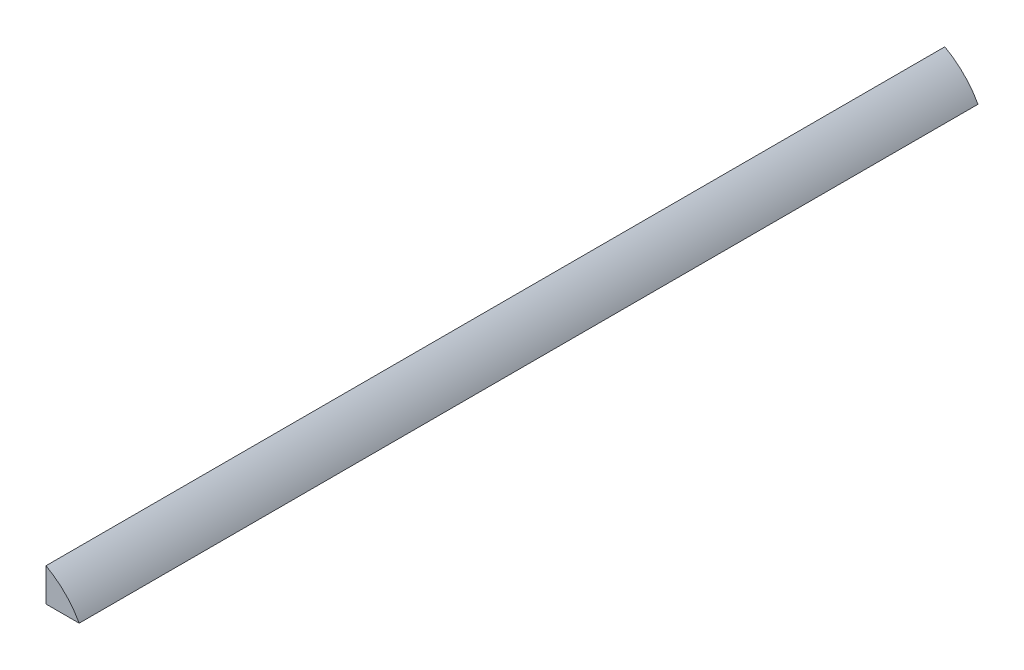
ISO-10303-21;
HEADER;
FILE_DESCRIPTION(('STEP AP214'),'2;1');
FILE_NAME('part.step','',(''),(''),'','','');
FILE_SCHEMA(('AUTOMOTIVE_DESIGN { 1 0 10303 214 1 1 1 1 }'));
ENDSEC;
DATA;
#1=APPLICATION_CONTEXT('core data for automotive mechanical design processes');
#2=APPLICATION_PROTOCOL_DEFINITION('international standard','automotive_design',2000,#1);
#3=PRODUCT_CONTEXT('',#1,'mechanical');
#4=PRODUCT('Part','Part','',(#3));
#5=PRODUCT_RELATED_PRODUCT_CATEGORY('part','',(#4));
#6=PRODUCT_DEFINITION_FORMATION('','',#4);
#7=PRODUCT_DEFINITION_CONTEXT('part definition',#1,'design');
#8=PRODUCT_DEFINITION('design','',#6,#7);
#9=PRODUCT_DEFINITION_SHAPE('','',#8);
#10=(LENGTH_UNIT() NAMED_UNIT(*) SI_UNIT(.MILLI.,.METRE.));
#11=(NAMED_UNIT(*) PLANE_ANGLE_UNIT() SI_UNIT($,.RADIAN.));
#12=(NAMED_UNIT(*) SI_UNIT($,.STERADIAN.) SOLID_ANGLE_UNIT());
#13=UNCERTAINTY_MEASURE_WITH_UNIT(LENGTH_MEASURE(1.E-05),#10,'distance_accuracy_value','');
#14=(GEOMETRIC_REPRESENTATION_CONTEXT(3) GLOBAL_UNCERTAINTY_ASSIGNED_CONTEXT((#13)) GLOBAL_UNIT_ASSIGNED_CONTEXT((#10,
#11,#12)) REPRESENTATION_CONTEXT('',''));
#15=CARTESIAN_POINT('',(0.,0.,0.));
#16=DIRECTION('',(0.,0.,1.));
#17=DIRECTION('',(1.,0.,0.));
#18=AXIS2_PLACEMENT_3D('',#15,#16,#17);
#19=CARTESIAN_POINT('',(-88.9,9.525,50.8));
#20=DIRECTION('',(0.,-1.,0.));
#21=DIRECTION('',(0.,0.,-1.));
#22=AXIS2_PLACEMENT_3D('',#19,#20,#21);
#23=PLANE('',#22);
#24=DIRECTION('',(1.,0.,0.));
#25=VECTOR('',#24,1.);
#26=CARTESIAN_POINT('',(69.85,9.525,-31.75));
#27=LINE('',#26,#25);
#28=CARTESIAN_POINT('',(79.375,9.52499999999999,-31.75));
#29=VERTEX_POINT('',#28);
#30=CARTESIAN_POINT('',(82.423,9.525,-31.75));
#31=VERTEX_POINT('',#30);
#32=EDGE_CURVE('E61',#29,#31,#27,.T.);
#33=ORIENTED_EDGE('',*,*,#32,.T.);
#34=DIRECTION('',(0.,0.,1.));
#35=VECTOR('',#34,1.);
#36=CARTESIAN_POINT('',(82.423,9.525,-31.75));
#37=LINE('',#36,#35);
#38=CARTESIAN_POINT('',(82.423,9.525,50.8));
#39=VERTEX_POINT('',#38);
#40=EDGE_CURVE('E32',#39,#31,#37,.F.);
#41=ORIENTED_EDGE('',*,*,#40,.F.);
#42=DIRECTION('',(1.,0.,0.));
#43=VECTOR('',#42,1.);
#44=CARTESIAN_POINT('',(-88.9,9.525,50.8));
#45=LINE('',#44,#43);
#46=CARTESIAN_POINT('',(79.3749999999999,9.525,50.8));
#47=VERTEX_POINT('',#46);
#48=EDGE_CURVE('E76',#47,#39,#45,.T.);
#49=ORIENTED_EDGE('',*,*,#48,.F.);
#50=DIRECTION('',(0.,0.,-1.));
#51=VECTOR('',#50,1.);
#52=CARTESIAN_POINT('',(79.375,9.525,50.8));
#53=LINE('',#52,#51);
#54=EDGE_CURVE('E58',#47,#29,#53,.T.);
#55=ORIENTED_EDGE('',*,*,#54,.T.);
#56=EDGE_LOOP('',(#33,#41,#49,#55));
#57=FACE_BOUND('',#56,.T.);
#58=ADVANCED_FACE('F28',(#57),#23,.T.);
#59=CARTESIAN_POINT('',(75.6186094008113,5.76860940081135,50.8));
#60=DIRECTION('',(0.,0.,1.));
#61=DIRECTION('',(1.,0.,0.));
#62=AXIS2_PLACEMENT_3D('',#59,#60,#61);
#63=PLANE('',#62);
#64=DIRECTION('',(0.,-1.,0.));
#65=VECTOR('',#64,1.);
#66=CARTESIAN_POINT('',(79.375,41.275,50.8));
#67=LINE('',#66,#65);
#68=CARTESIAN_POINT('',(79.375,12.573,50.8));
#69=VERTEX_POINT('',#68);
#70=EDGE_CURVE('E81',#69,#47,#67,.T.);
#71=ORIENTED_EDGE('',*,*,#70,.T.);
#72=ORIENTED_EDGE('',*,*,#48,.T.);
#73=CARTESIAN_POINT('',(75.6186094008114,5.76860940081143,50.8));
#74=DIRECTION('',(0.,0.,1.));
#75=DIRECTION('',(1.,0.,0.));
#76=AXIS2_PLACEMENT_3D('',#73,#74,#75);
#77=CIRCLE('',#76,7.77239999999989);
#78=EDGE_CURVE('E71',#69,#39,#77,.F.);
#79=ORIENTED_EDGE('',*,*,#78,.F.);
#80=EDGE_LOOP('',(#71,#72,#79));
#81=FACE_BOUND('',#80,.T.);
#82=ADVANCED_FACE('F92',(#81),#63,.T.);
#83=CARTESIAN_POINT('',(79.375,9.525,50.8));
#84=DIRECTION('',(1.,0.,0.));
#85=DIRECTION('',(0.,0.,-1.));
#86=AXIS2_PLACEMENT_3D('',#83,#84,#85);
#87=PLANE('',#86);
#88=DIRECTION('',(0.,-1.,0.));
#89=VECTOR('',#88,1.);
#90=CARTESIAN_POINT('',(79.375,41.275,-31.75));
#91=LINE('',#90,#89);
#92=CARTESIAN_POINT('',(79.375,12.573,-31.75));
#93=VERTEX_POINT('',#92);
#94=EDGE_CURVE('E65',#93,#29,#91,.T.);
#95=ORIENTED_EDGE('',*,*,#94,.T.);
#96=ORIENTED_EDGE('',*,*,#54,.F.);
#97=ORIENTED_EDGE('',*,*,#70,.F.);
#98=DIRECTION('',(0.,0.,1.));
#99=VECTOR('',#98,1.);
#100=CARTESIAN_POINT('',(79.375,12.573,-31.75));
#101=LINE('',#100,#99);
#102=EDGE_CURVE('E38',#93,#69,#101,.T.);
#103=ORIENTED_EDGE('',*,*,#102,.F.);
#104=EDGE_LOOP('',(#95,#96,#97,#103));
#105=FACE_BOUND('',#104,.T.);
#106=ADVANCED_FACE('F94',(#105),#87,.F.);
#107=CARTESIAN_POINT('',(75.6186094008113,5.76860940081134,-31.75));
#108=DIRECTION('',(0.,0.,1.));
#109=DIRECTION('',(1.,0.,0.));
#110=AXIS2_PLACEMENT_3D('',#107,#108,#109);
#111=PLANE('',#110);
#112=ORIENTED_EDGE('',*,*,#94,.F.);
#113=CARTESIAN_POINT('',(75.6186094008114,5.76860940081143,-31.75));
#114=DIRECTION('',(0.,0.,1.));
#115=DIRECTION('',(1.,0.,0.));
#116=AXIS2_PLACEMENT_3D('',#113,#114,#115);
#117=CIRCLE('',#116,7.77239999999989);
#118=EDGE_CURVE('E11',#31,#93,#117,.T.);
#119=ORIENTED_EDGE('',*,*,#118,.F.);
#120=ORIENTED_EDGE('',*,*,#32,.F.);
#121=EDGE_LOOP('',(#112,#119,#120));
#122=FACE_BOUND('',#121,.T.);
#123=ADVANCED_FACE('F67',(#122),#111,.F.);
#124=CARTESIAN_POINT('',(75.6186094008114,5.76860940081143,-31.75));
#125=DIRECTION('',(0.,0.,1.));
#126=DIRECTION('',(1.,0.,0.));
#127=AXIS2_PLACEMENT_3D('',#124,#125,#126);
#128=CYLINDRICAL_SURFACE('',#127,7.77239999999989);
#129=ORIENTED_EDGE('',*,*,#118,.T.);
#130=ORIENTED_EDGE('',*,*,#102,.T.);
#131=ORIENTED_EDGE('',*,*,#78,.T.);
#132=ORIENTED_EDGE('',*,*,#40,.T.);
#133=EDGE_LOOP('',(#129,#130,#131,#132));
#134=FACE_BOUND('',#133,.T.);
#135=ADVANCED_FACE('F30',(#134),#128,.T.);
#136=CLOSED_SHELL('',(#58,#82,#106,#123,#135));
#137=MANIFOLD_SOLID_BREP('B2',#136);
#138=ADVANCED_BREP_SHAPE_REPRESENTATION('',(#18,#137),#14);
#139=SHAPE_DEFINITION_REPRESENTATION(#9,#138);
ENDSEC;
END-ISO-10303-21;
